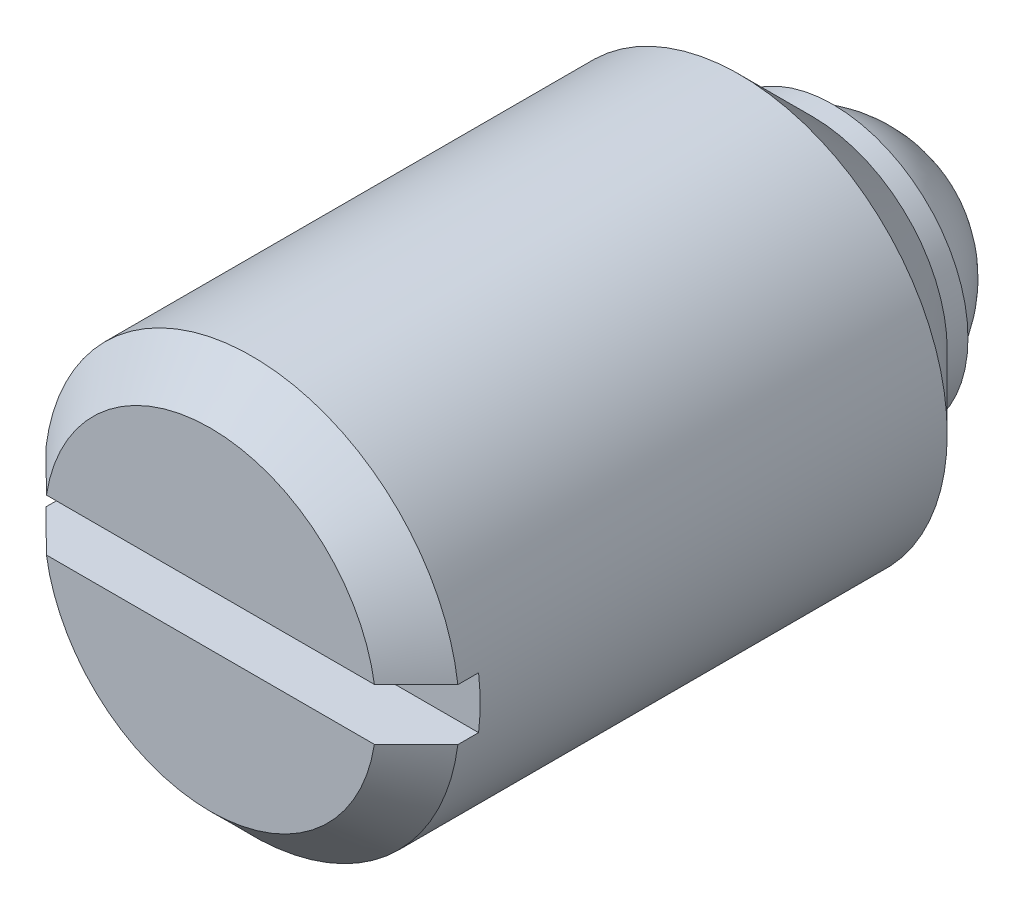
ISO-10303-21;
HEADER;
FILE_DESCRIPTION(('STEP AP214'),'2;1');
FILE_NAME('part.step','',(''),(''),'','','');
FILE_SCHEMA(('AUTOMOTIVE_DESIGN { 1 0 10303 214 1 1 1 1 }'));
ENDSEC;
DATA;
#1=APPLICATION_CONTEXT('core data for automotive mechanical design processes');
#2=APPLICATION_PROTOCOL_DEFINITION('international standard','automotive_design',2000,#1);
#3=PRODUCT_CONTEXT('',#1,'mechanical');
#4=PRODUCT('Part','Part','',(#3));
#5=PRODUCT_RELATED_PRODUCT_CATEGORY('part','',(#4));
#6=PRODUCT_DEFINITION_FORMATION('','',#4);
#7=PRODUCT_DEFINITION_CONTEXT('part definition',#1,'design');
#8=PRODUCT_DEFINITION('design','',#6,#7);
#9=PRODUCT_DEFINITION_SHAPE('','',#8);
#10=(LENGTH_UNIT() NAMED_UNIT(*) SI_UNIT(.MILLI.,.METRE.));
#11=(NAMED_UNIT(*) PLANE_ANGLE_UNIT() SI_UNIT($,.RADIAN.));
#12=(NAMED_UNIT(*) SI_UNIT($,.STERADIAN.) SOLID_ANGLE_UNIT());
#13=UNCERTAINTY_MEASURE_WITH_UNIT(LENGTH_MEASURE(1.E-05),#10,'distance_accuracy_value','');
#14=(GEOMETRIC_REPRESENTATION_CONTEXT(3) GLOBAL_UNCERTAINTY_ASSIGNED_CONTEXT((#13)) GLOBAL_UNIT_ASSIGNED_CONTEXT((#10,
#11,#12)) REPRESENTATION_CONTEXT('',''));
#15=CARTESIAN_POINT('',(0.,0.,0.));
#16=DIRECTION('',(0.,0.,1.));
#17=DIRECTION('',(1.,0.,0.));
#18=AXIS2_PLACEMENT_3D('',#15,#16,#17);
#19=CARTESIAN_POINT('',(0.,0.,-5.5));
#20=DIRECTION('',(0.,0.,-1.));
#21=DIRECTION('',(-1.,0.,0.));
#22=AXIS2_PLACEMENT_3D('',#19,#20,#21);
#23=CYLINDRICAL_SURFACE('',#22,10.);
#24=CARTESIAN_POINT('',(0.,0.,31.5));
#25=DIRECTION('',(0.,0.,1.));
#26=DIRECTION('',(1.,0.,0.));
#27=AXIS2_PLACEMENT_3D('',#24,#25,#26);
#28=CIRCLE('',#27,10.);
#29=CARTESIAN_POINT('',(-9.92156741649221,1.25,31.5));
#30=VERTEX_POINT('',#29);
#31=CARTESIAN_POINT('',(-9.92156741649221,-1.25,31.5));
#32=VERTEX_POINT('',#31);
#33=EDGE_CURVE('E71',#30,#32,#28,.T.);
#34=ORIENTED_EDGE('',*,*,#33,.F.);
#35=DIRECTION('',(0.,0.,1.));
#36=VECTOR('',#35,1.);
#37=CARTESIAN_POINT('',(-9.92156741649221,1.25,32.));
#38=LINE('',#37,#36);
#39=CARTESIAN_POINT('',(-9.92156741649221,1.25,32.5));
#40=VERTEX_POINT('',#39);
#41=EDGE_CURVE('E111',#30,#40,#38,.T.);
#42=ORIENTED_EDGE('',*,*,#41,.T.);
#43=CARTESIAN_POINT('',(0.,0.,32.5));
#44=DIRECTION('',(0.,0.,1.));
#45=DIRECTION('',(1.,0.,0.));
#46=AXIS2_PLACEMENT_3D('',#43,#44,#45);
#47=CIRCLE('',#46,10.);
#48=CARTESIAN_POINT('',(9.92156741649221,1.25,32.5));
#49=VERTEX_POINT('',#48);
#50=EDGE_CURVE('E116',#40,#49,#47,.F.);
#51=ORIENTED_EDGE('',*,*,#50,.T.);
#52=DIRECTION('',(0.,0.,1.));
#53=VECTOR('',#52,1.);
#54=CARTESIAN_POINT('',(9.92156741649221,1.25,32.));
#55=LINE('',#54,#53);
#56=CARTESIAN_POINT('',(9.92156741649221,1.25,31.5));
#57=VERTEX_POINT('',#56);
#58=EDGE_CURVE('E109',#57,#49,#55,.T.);
#59=ORIENTED_EDGE('',*,*,#58,.F.);
#60=CARTESIAN_POINT('',(0.,0.,31.5));
#61=DIRECTION('',(0.,0.,1.));
#62=DIRECTION('',(1.,0.,0.));
#63=AXIS2_PLACEMENT_3D('',#60,#61,#62);
#64=CIRCLE('',#63,10.);
#65=CARTESIAN_POINT('',(9.92156741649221,-1.25,31.5));
#66=VERTEX_POINT('',#65);
#67=EDGE_CURVE('E85',#66,#57,#64,.T.);
#68=ORIENTED_EDGE('',*,*,#67,.F.);
#69=DIRECTION('',(0.,0.,1.));
#70=VECTOR('',#69,1.);
#71=CARTESIAN_POINT('',(9.92156741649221,-1.25,32.));
#72=LINE('',#71,#70);
#73=CARTESIAN_POINT('',(9.92156741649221,-1.25,32.5));
#74=VERTEX_POINT('',#73);
#75=EDGE_CURVE('E76',#66,#74,#72,.T.);
#76=ORIENTED_EDGE('',*,*,#75,.T.);
#77=CARTESIAN_POINT('',(0.,0.,32.5));
#78=DIRECTION('',(0.,0.,1.));
#79=DIRECTION('',(1.,0.,0.));
#80=AXIS2_PLACEMENT_3D('',#77,#78,#79);
#81=CIRCLE('',#80,10.);
#82=CARTESIAN_POINT('',(-9.92156741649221,-1.25,32.5));
#83=VERTEX_POINT('',#82);
#84=EDGE_CURVE('E74',#74,#83,#81,.F.);
#85=ORIENTED_EDGE('',*,*,#84,.T.);
#86=DIRECTION('',(0.,0.,1.));
#87=VECTOR('',#86,1.);
#88=CARTESIAN_POINT('',(-9.92156741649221,-1.25,32.));
#89=LINE('',#88,#87);
#90=EDGE_CURVE('E66',#32,#83,#89,.T.);
#91=ORIENTED_EDGE('',*,*,#90,.F.);
#92=EDGE_LOOP('',(#34,#42,#51,#59,#68,#76,#85,#91));
#93=FACE_BOUND('',#92,.T.);
#94=CARTESIAN_POINT('',(0.,0.,9.));
#95=DIRECTION('',(0.,0.,1.));
#96=DIRECTION('',(1.,0.,0.));
#97=AXIS2_PLACEMENT_3D('',#94,#95,#96);
#98=CIRCLE('',#97,10.);
#99=CARTESIAN_POINT('',(10.,0.,9.));
#100=VERTEX_POINT('',#99);
#101=EDGE_CURVE('E95',#100,#100,#98,.T.);
#102=ORIENTED_EDGE('',*,*,#101,.T.);
#103=EDGE_LOOP('',(#102));
#104=FACE_BOUND('',#103,.T.);
#105=ADVANCED_FACE('F14',(#93,#104),#23,.T.);
#106=CARTESIAN_POINT('',(0.,10.,34.5));
#107=DIRECTION('',(0.,0.,1.));
#108=DIRECTION('',(1.,0.,0.));
#109=AXIS2_PLACEMENT_3D('',#106,#107,#108);
#110=PLANE('',#109);
#111=DIRECTION('',(1.,0.,0.));
#112=VECTOR('',#111,1.);
#113=CARTESIAN_POINT('',(-9.92156741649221,1.25,34.5));
#114=LINE('',#113,#112);
#115=CARTESIAN_POINT('',(-7.90174031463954,1.25,34.5));
#116=VERTEX_POINT('',#115);
#117=CARTESIAN_POINT('',(7.90174031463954,1.25,34.5));
#118=VERTEX_POINT('',#117);
#119=EDGE_CURVE('E77',#116,#118,#114,.T.);
#120=ORIENTED_EDGE('',*,*,#119,.T.);
#121=CARTESIAN_POINT('',(0.,0.,34.5));
#122=DIRECTION('',(0.,0.,1.));
#123=DIRECTION('',(1.,0.,0.));
#124=AXIS2_PLACEMENT_3D('',#121,#122,#123);
#125=CIRCLE('',#124,8.);
#126=EDGE_CURVE('E9',#118,#116,#125,.T.);
#127=ORIENTED_EDGE('',*,*,#126,.T.);
#128=EDGE_LOOP('',(#120,#127));
#129=FACE_BOUND('',#128,.T.);
#130=ADVANCED_FACE('F178',(#129),#110,.T.);
#131=DIRECTION('',(1.,0.,0.));
#132=VECTOR('',#131,1.);
#133=CARTESIAN_POINT('',(-9.92156741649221,-1.25,34.5));
#134=LINE('',#133,#132);
#135=CARTESIAN_POINT('',(-7.90174031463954,-1.25,34.5));
#136=VERTEX_POINT('',#135);
#137=CARTESIAN_POINT('',(7.90174031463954,-1.25,34.5));
#138=VERTEX_POINT('',#137);
#139=EDGE_CURVE('E104',#136,#138,#134,.T.);
#140=ORIENTED_EDGE('',*,*,#139,.F.);
#141=CARTESIAN_POINT('',(0.,0.,34.5));
#142=DIRECTION('',(0.,0.,1.));
#143=DIRECTION('',(1.,0.,0.));
#144=AXIS2_PLACEMENT_3D('',#141,#142,#143);
#145=CIRCLE('',#144,8.);
#146=EDGE_CURVE('E161',#136,#138,#145,.T.);
#147=ORIENTED_EDGE('',*,*,#146,.T.);
#148=EDGE_LOOP('',(#140,#147));
#149=FACE_BOUND('',#148,.T.);
#150=ADVANCED_FACE('F147',(#149),#110,.T.);
#151=CARTESIAN_POINT('',(-9.92156741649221,1.25,32.));
#152=DIRECTION('',(0.,-1.,0.));
#153=DIRECTION('',(1.,0.,0.));
#154=AXIS2_PLACEMENT_3D('',#151,#152,#153);
#155=PLANE('',#154);
#156=ORIENTED_EDGE('',*,*,#58,.T.);
#157=CARTESIAN_POINT('',(9.92156741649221,1.25,32.5));
#158=CARTESIAN_POINT('',(9.75341399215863,1.25,32.6668337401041));
#159=CARTESIAN_POINT('',(9.58522823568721,1.25,32.8336349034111));
#160=CARTESIAN_POINT('',(9.2487791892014,1.25,33.1671589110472));
#161=CARTESIAN_POINT('',(9.08051589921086,1.25,33.3338817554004));
#162=CARTESIAN_POINT('',(8.74389879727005,1.25,33.6672360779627));
#163=CARTESIAN_POINT('',(8.57554498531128,1.25,33.8338675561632));
#164=CARTESIAN_POINT('',(8.23872867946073,1.25,34.1670207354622));
#165=CARTESIAN_POINT('',(8.07026618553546,1.25,34.3335424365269));
#166=CARTESIAN_POINT('',(7.90174031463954,1.25,34.5));
#167=B_SPLINE_CURVE_WITH_KNOTS('',3,(#157,#158,#159,#160,#161,#162,#163,#164,#165,#166),
.UNSPECIFIED.,.F.,.F.,(4,2,2,2,4),(0.,0.710620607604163,1.42124099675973,2.1318614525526,
2.84248212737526),.UNSPECIFIED.);
#168=EDGE_CURVE('E23',#49,#118,#167,.T.);
#169=ORIENTED_EDGE('',*,*,#168,.T.);
#170=ORIENTED_EDGE('',*,*,#119,.F.);
#171=CARTESIAN_POINT('',(-7.90174031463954,1.25,34.5));
#172=CARTESIAN_POINT('',(-8.07026618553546,1.25,34.3335424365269));
#173=CARTESIAN_POINT('',(-8.23872867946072,1.25,34.1670207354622));
#174=CARTESIAN_POINT('',(-8.57554498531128,1.25,33.8338675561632));
#175=CARTESIAN_POINT('',(-8.74389879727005,1.25,33.6672360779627));
#176=CARTESIAN_POINT('',(-9.08051589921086,1.25,33.3338817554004));
#177=CARTESIAN_POINT('',(-9.2487791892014,1.25,33.1671589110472));
#178=CARTESIAN_POINT('',(-9.58522823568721,1.25,32.8336349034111));
#179=CARTESIAN_POINT('',(-9.75341399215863,1.25,32.6668337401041));
#180=CARTESIAN_POINT('',(-9.92156741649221,1.25,32.5));
#181=B_SPLINE_CURVE_WITH_KNOTS('',3,(#171,#172,#173,#174,#175,#176,#177,#178,#179,#180),
.UNSPECIFIED.,.F.,.F.,(4,2,2,2,4),(0.,0.710620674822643,1.42124113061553,2.13186151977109,
2.84248212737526),.UNSPECIFIED.);
#182=EDGE_CURVE('E152',#116,#40,#181,.T.);
#183=ORIENTED_EDGE('',*,*,#182,.T.);
#184=ORIENTED_EDGE('',*,*,#41,.F.);
#185=DIRECTION('',(-1.,0.,0.));
#186=VECTOR('',#185,1.);
#187=CARTESIAN_POINT('',(9.92156741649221,1.25,31.5));
#188=LINE('',#187,#186);
#189=EDGE_CURVE('E90',#57,#30,#188,.T.);
#190=ORIENTED_EDGE('',*,*,#189,.F.);
#191=EDGE_LOOP('',(#156,#169,#170,#183,#184,#190));
#192=FACE_BOUND('',#191,.T.);
#193=ADVANCED_FACE('F141',(#192),#155,.T.);
#194=CARTESIAN_POINT('',(-9.92156741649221,-1.25,32.));
#195=DIRECTION('',(0.,-1.,0.));
#196=DIRECTION('',(1.,0.,0.));
#197=AXIS2_PLACEMENT_3D('',#194,#195,#196);
#198=PLANE('',#197);
#199=ORIENTED_EDGE('',*,*,#90,.T.);
#200=CARTESIAN_POINT('',(-9.92156741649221,-1.25,32.5));
#201=CARTESIAN_POINT('',(-9.75341399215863,-1.25,32.6668337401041));
#202=CARTESIAN_POINT('',(-9.58522823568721,-1.25,32.8336349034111));
#203=CARTESIAN_POINT('',(-9.2487791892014,-1.25,33.1671589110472));
#204=CARTESIAN_POINT('',(-9.08051589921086,-1.25,33.3338817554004));
#205=CARTESIAN_POINT('',(-8.74389879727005,-1.25,33.6672360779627));
#206=CARTESIAN_POINT('',(-8.57554498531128,-1.25,33.8338675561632));
#207=CARTESIAN_POINT('',(-8.23872867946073,-1.25,34.1670207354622));
#208=CARTESIAN_POINT('',(-8.07026618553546,-1.25,34.3335424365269));
#209=CARTESIAN_POINT('',(-7.90174031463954,-1.25,34.5));
#210=B_SPLINE_CURVE_WITH_KNOTS('',3,(#200,#201,#202,#203,#204,#205,#206,#207,#208,#209),
.UNSPECIFIED.,.F.,.F.,(4,2,2,2,4),(0.,0.710620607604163,1.42124099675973,2.1318614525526,
2.84248212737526),.UNSPECIFIED.);
#211=EDGE_CURVE('E127',#83,#136,#210,.T.);
#212=ORIENTED_EDGE('',*,*,#211,.T.);
#213=ORIENTED_EDGE('',*,*,#139,.T.);
#214=CARTESIAN_POINT('',(7.90174031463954,-1.25,34.5));
#215=CARTESIAN_POINT('',(8.07026618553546,-1.25,34.3335424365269));
#216=CARTESIAN_POINT('',(8.23872867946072,-1.25,34.1670207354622));
#217=CARTESIAN_POINT('',(8.57554498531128,-1.25,33.8338675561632));
#218=CARTESIAN_POINT('',(8.74389879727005,-1.25,33.6672360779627));
#219=CARTESIAN_POINT('',(9.08051589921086,-1.25,33.3338817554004));
#220=CARTESIAN_POINT('',(9.2487791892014,-1.25,33.1671589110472));
#221=CARTESIAN_POINT('',(9.58522823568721,-1.25,32.8336349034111));
#222=CARTESIAN_POINT('',(9.75341399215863,-1.25,32.6668337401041));
#223=CARTESIAN_POINT('',(9.92156741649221,-1.25,32.5));
#224=B_SPLINE_CURVE_WITH_KNOTS('',3,(#214,#215,#216,#217,#218,#219,#220,#221,#222,#223),
.UNSPECIFIED.,.F.,.F.,(4,2,2,2,4),(0.,0.710620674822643,1.42124113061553,2.13186151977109,
2.84248212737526),.UNSPECIFIED.);
#225=EDGE_CURVE('E120',#138,#74,#224,.T.);
#226=ORIENTED_EDGE('',*,*,#225,.T.);
#227=ORIENTED_EDGE('',*,*,#75,.F.);
#228=DIRECTION('',(1.,0.,0.));
#229=VECTOR('',#228,1.);
#230=CARTESIAN_POINT('',(-9.92156741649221,-1.25,31.5));
#231=LINE('',#230,#229);
#232=EDGE_CURVE('E80',#32,#66,#231,.T.);
#233=ORIENTED_EDGE('',*,*,#232,.F.);
#234=EDGE_LOOP('',(#199,#212,#213,#226,#227,#233));
#235=FACE_BOUND('',#234,.T.);
#236=ADVANCED_FACE('F81',(#235),#198,.F.);
#237=CARTESIAN_POINT('',(0.,0.,38.5593183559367));
#238=DIRECTION('',(0.,0.,1.));
#239=DIRECTION('',(1.,0.,0.));
#240=AXIS2_PLACEMENT_3D('',#237,#238,#239);
#241=CYLINDRICAL_SURFACE('',#240,6.5);
#242=CARTESIAN_POINT('',(0.,0.,4.5));
#243=DIRECTION('',(0.,0.,1.));
#244=DIRECTION('',(1.,0.,0.));
#245=AXIS2_PLACEMENT_3D('',#242,#243,#244);
#246=CIRCLE('',#245,6.5);
#247=CARTESIAN_POINT('',(6.5,0.,4.5));
#248=VERTEX_POINT('',#247);
#249=EDGE_CURVE('E101',#248,#248,#246,.T.);
#250=ORIENTED_EDGE('',*,*,#249,.T.);
#251=EDGE_LOOP('',(#250));
#252=FACE_BOUND('',#251,.T.);
#253=CARTESIAN_POINT('',(0.,0.,5.5));
#254=DIRECTION('',(0.,0.,1.));
#255=DIRECTION('',(1.,0.,0.));
#256=AXIS2_PLACEMENT_3D('',#253,#254,#255);
#257=CIRCLE('',#256,6.5);
#258=CARTESIAN_POINT('',(6.5,0.,5.5));
#259=VERTEX_POINT('',#258);
#260=EDGE_CURVE('E98',#259,#259,#257,.T.);
#261=ORIENTED_EDGE('',*,*,#260,.F.);
#262=EDGE_LOOP('',(#261));
#263=FACE_BOUND('',#262,.T.);
#264=ADVANCED_FACE('F140',(#252,#263),#241,.T.);
#265=CARTESIAN_POINT('',(0.,0.,9.));
#266=DIRECTION('',(0.,0.,1.));
#267=DIRECTION('',(1.,0.,0.));
#268=AXIS2_PLACEMENT_3D('',#265,#266,#267);
#269=CONICAL_SURFACE('',#268,10.,0.785398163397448);
#270=ORIENTED_EDGE('',*,*,#260,.T.);
#271=EDGE_LOOP('',(#270));
#272=FACE_BOUND('',#271,.T.);
#273=ORIENTED_EDGE('',*,*,#101,.F.);
#274=EDGE_LOOP('',(#273));
#275=FACE_BOUND('',#274,.T.);
#276=ADVANCED_FACE('F186',(#272,#275),#269,.T.);
#277=CARTESIAN_POINT('',(0.,0.,6.));
#278=DIRECTION('',(-1.,0.,0.));
#279=DIRECTION('',(0.,0.,1.));
#280=AXIS2_PLACEMENT_3D('',#277,#278,#279);
#281=SPHERICAL_SURFACE('',#280,6.);
#282=CARTESIAN_POINT('',(0.,0.,6.));
#283=DIRECTION('',(0.,0.,-1.));
#284=DIRECTION('',(-1.,0.,0.));
#285=AXIS2_PLACEMENT_3D('',#282,#283,#284);
#286=SPHERICAL_SURFACE('',#285,6.);
#287=CARTESIAN_POINT('',(0.,0.,4.5));
#288=DIRECTION('',(0.,0.,-1.));
#289=DIRECTION('',(-1.,0.,0.));
#290=AXIS2_PLACEMENT_3D('',#287,#288,#289);
#291=CIRCLE('',#290,5.80947501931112);
#292=CARTESIAN_POINT('',(-5.80947501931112,0.,4.5));
#293=VERTEX_POINT('',#292);
#294=EDGE_CURVE('E113',#293,#293,#291,.T.);
#295=ORIENTED_EDGE('',*,*,#294,.T.);
#296=EDGE_LOOP('',(#295));
#297=FACE_BOUND('',#296,.T.);
#298=ADVANCED_FACE('F184',(#297),#286,.T.);
#299=CARTESIAN_POINT('',(0.,5.80947501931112,4.5));
#300=DIRECTION('',(0.,0.,-1.));
#301=DIRECTION('',(-1.,0.,0.));
#302=AXIS2_PLACEMENT_3D('',#299,#300,#301);
#303=PLANE('',#302);
#304=ORIENTED_EDGE('',*,*,#294,.F.);
#305=EDGE_LOOP('',(#304));
#306=FACE_BOUND('',#305,.T.);
#307=ORIENTED_EDGE('',*,*,#249,.F.);
#308=EDGE_LOOP('',(#307));
#309=FACE_BOUND('',#308,.T.);
#310=ADVANCED_FACE('F148',(#306,#309),#303,.T.);
#311=CARTESIAN_POINT('',(0.,0.,32.5));
#312=DIRECTION('',(0.,0.,-1.));
#313=DIRECTION('',(-1.,0.,0.));
#314=AXIS2_PLACEMENT_3D('',#311,#312,#313);
#315=CONICAL_SURFACE('',#314,10.,0.78539816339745);
#316=ORIENTED_EDGE('',*,*,#225,.F.);
#317=ORIENTED_EDGE('',*,*,#146,.F.);
#318=ORIENTED_EDGE('',*,*,#211,.F.);
#319=ORIENTED_EDGE('',*,*,#84,.F.);
#320=EDGE_LOOP('',(#316,#317,#318,#319));
#321=FACE_BOUND('',#320,.T.);
#322=ADVANCED_FACE('F133',(#321),#315,.T.);
#323=CARTESIAN_POINT('',(0.,0.,32.5));
#324=DIRECTION('',(0.,0.,-1.));
#325=DIRECTION('',(-1.,0.,0.));
#326=AXIS2_PLACEMENT_3D('',#323,#324,#325);
#327=CONICAL_SURFACE('',#326,10.,0.78539816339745);
#328=ORIENTED_EDGE('',*,*,#182,.F.);
#329=ORIENTED_EDGE('',*,*,#126,.F.);
#330=ORIENTED_EDGE('',*,*,#168,.F.);
#331=ORIENTED_EDGE('',*,*,#50,.F.);
#332=EDGE_LOOP('',(#328,#329,#330,#331));
#333=FACE_BOUND('',#332,.T.);
#334=ADVANCED_FACE('F16',(#333),#327,.T.);
#335=CARTESIAN_POINT('',(0.,0.,31.5));
#336=DIRECTION('',(0.,0.,1.));
#337=DIRECTION('',(1.,0.,0.));
#338=AXIS2_PLACEMENT_3D('',#335,#336,#337);
#339=PLANE('',#338);
#340=ORIENTED_EDGE('',*,*,#33,.T.);
#341=ORIENTED_EDGE('',*,*,#232,.T.);
#342=ORIENTED_EDGE('',*,*,#67,.T.);
#343=ORIENTED_EDGE('',*,*,#189,.T.);
#344=EDGE_LOOP('',(#340,#341,#342,#343));
#345=FACE_BOUND('',#344,.T.);
#346=ADVANCED_FACE('F88',(#345),#339,.T.);
#347=CLOSED_SHELL('',(#105,#130,#150,#193,#236,#264,#276,#298,#310,#322,#334,#346));
#348=MANIFOLD_SOLID_BREP('B1',#347);
#349=ADVANCED_BREP_SHAPE_REPRESENTATION('',(#18,#348),#14);
#350=SHAPE_DEFINITION_REPRESENTATION(#9,#349);
ENDSEC;
END-ISO-10303-21;
